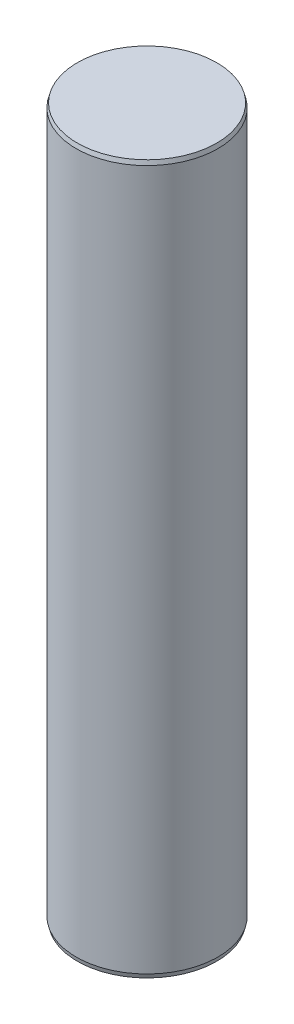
ISO-10303-21;
HEADER;
FILE_DESCRIPTION(('STEP AP214'),'2;1');
FILE_NAME('part.step','',(''),(''),'','','');
FILE_SCHEMA(('AUTOMOTIVE_DESIGN { 1 0 10303 214 1 1 1 1 }'));
ENDSEC;
DATA;
#1=APPLICATION_CONTEXT('core data for automotive mechanical design processes');
#2=APPLICATION_PROTOCOL_DEFINITION('international standard','automotive_design',2000,#1);
#3=PRODUCT_CONTEXT('',#1,'mechanical');
#4=PRODUCT('Part','Part','',(#3));
#5=PRODUCT_RELATED_PRODUCT_CATEGORY('part','',(#4));
#6=PRODUCT_DEFINITION_FORMATION('','',#4);
#7=PRODUCT_DEFINITION_CONTEXT('part definition',#1,'design');
#8=PRODUCT_DEFINITION('design','',#6,#7);
#9=PRODUCT_DEFINITION_SHAPE('','',#8);
#10=(LENGTH_UNIT() NAMED_UNIT(*) SI_UNIT(.MILLI.,.METRE.));
#11=(NAMED_UNIT(*) PLANE_ANGLE_UNIT() SI_UNIT($,.RADIAN.));
#12=(NAMED_UNIT(*) SI_UNIT($,.STERADIAN.) SOLID_ANGLE_UNIT());
#13=UNCERTAINTY_MEASURE_WITH_UNIT(LENGTH_MEASURE(1.E-05),#10,'distance_accuracy_value','');
#14=(GEOMETRIC_REPRESENTATION_CONTEXT(3) GLOBAL_UNCERTAINTY_ASSIGNED_CONTEXT((#13)) GLOBAL_UNIT_ASSIGNED_CONTEXT((#10,
#11,#12)) REPRESENTATION_CONTEXT('',''));
#15=CARTESIAN_POINT('',(0.,0.,0.));
#16=DIRECTION('',(0.,0.,1.));
#17=DIRECTION('',(1.,0.,0.));
#18=AXIS2_PLACEMENT_3D('',#15,#16,#17);
#19=CARTESIAN_POINT('',(0.,-20.,0.));
#20=DIRECTION('',(0.,1.,0.));
#21=DIRECTION('',(0.,0.,1.));
#22=AXIS2_PLACEMENT_3D('',#19,#20,#21);
#23=CONICAL_SURFACE('',#22,1.96784609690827,0.261799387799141);
#24=CARTESIAN_POINT('',(0.,-19.88,0.));
#25=DIRECTION('',(0.,-1.,0.));
#26=DIRECTION('',(0.,0.,-1.));
#27=AXIS2_PLACEMENT_3D('',#24,#25,#26);
#28=CIRCLE('',#27,2.);
#29=CARTESIAN_POINT('',(0.,-19.88,-2.));
#30=VERTEX_POINT('',#29);
#31=EDGE_CURVE('E10',#30,#30,#28,.T.);
#32=ORIENTED_EDGE('',*,*,#31,.T.);
#33=EDGE_LOOP('',(#32));
#34=FACE_BOUND('',#33,.T.);
#35=CARTESIAN_POINT('',(0.,-20.,0.));
#36=DIRECTION('',(0.,-1.,0.));
#37=DIRECTION('',(0.,0.,-1.));
#38=AXIS2_PLACEMENT_3D('',#35,#36,#37);
#39=CIRCLE('',#38,1.96784609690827);
#40=CARTESIAN_POINT('',(0.,-20.,-1.96784609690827));
#41=VERTEX_POINT('',#40);
#42=EDGE_CURVE('E43',#41,#41,#39,.T.);
#43=ORIENTED_EDGE('',*,*,#42,.F.);
#44=EDGE_LOOP('',(#43));
#45=FACE_BOUND('',#44,.T.);
#46=ADVANCED_FACE('F29',(#34,#45),#23,.T.);
#47=CARTESIAN_POINT('',(0.,0.,0.));
#48=DIRECTION('',(0.,-1.,0.));
#49=DIRECTION('',(0.,0.,-1.));
#50=AXIS2_PLACEMENT_3D('',#47,#48,#49);
#51=CYLINDRICAL_SURFACE('',#50,2.);
#52=CARTESIAN_POINT('',(0.,-0.120000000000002,0.));
#53=DIRECTION('',(0.,-1.,0.));
#54=DIRECTION('',(0.,0.,-1.));
#55=AXIS2_PLACEMENT_3D('',#52,#53,#54);
#56=CIRCLE('',#55,2.00000000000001);
#57=CARTESIAN_POINT('',(0.,-0.120000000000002,-2.00000000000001));
#58=VERTEX_POINT('',#57);
#59=EDGE_CURVE('E35',#58,#58,#56,.T.);
#60=ORIENTED_EDGE('',*,*,#59,.T.);
#61=EDGE_LOOP('',(#60));
#62=FACE_BOUND('',#61,.T.);
#63=ORIENTED_EDGE('',*,*,#31,.F.);
#64=EDGE_LOOP('',(#63));
#65=FACE_BOUND('',#64,.T.);
#66=ADVANCED_FACE('F52',(#62,#65),#51,.T.);
#67=CARTESIAN_POINT('',(0.,-0.120000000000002,0.));
#68=DIRECTION('',(0.,-1.,0.));
#69=DIRECTION('',(0.,0.,-1.));
#70=AXIS2_PLACEMENT_3D('',#67,#68,#69);
#71=CONICAL_SURFACE('',#70,2.00000000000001,0.261799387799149);
#72=CARTESIAN_POINT('',(0.,0.,0.));
#73=DIRECTION('',(0.,-1.,0.));
#74=DIRECTION('',(0.,0.,-1.));
#75=AXIS2_PLACEMENT_3D('',#72,#73,#74);
#76=CIRCLE('',#75,1.96784609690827);
#77=CARTESIAN_POINT('',(0.,0.,-1.96784609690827));
#78=VERTEX_POINT('',#77);
#79=EDGE_CURVE('E39',#78,#78,#76,.T.);
#80=ORIENTED_EDGE('',*,*,#79,.T.);
#81=EDGE_LOOP('',(#80));
#82=FACE_BOUND('',#81,.T.);
#83=ORIENTED_EDGE('',*,*,#59,.F.);
#84=EDGE_LOOP('',(#83));
#85=FACE_BOUND('',#84,.T.);
#86=ADVANCED_FACE('F56',(#82,#85),#71,.T.);
#87=CARTESIAN_POINT('',(0.,0.,0.));
#88=DIRECTION('',(0.,1.,0.));
#89=DIRECTION('',(0.,0.,1.));
#90=AXIS2_PLACEMENT_3D('',#87,#88,#89);
#91=PLANE('',#90);
#92=ORIENTED_EDGE('',*,*,#79,.F.);
#93=EDGE_LOOP('',(#92));
#94=FACE_BOUND('',#93,.T.);
#95=ADVANCED_FACE('F60',(#94),#91,.T.);
#96=CARTESIAN_POINT('',(0.,-20.,0.));
#97=DIRECTION('',(0.,-1.,0.));
#98=DIRECTION('',(0.,0.,-1.));
#99=AXIS2_PLACEMENT_3D('',#96,#97,#98);
#100=PLANE('',#99);
#101=ORIENTED_EDGE('',*,*,#42,.T.);
#102=EDGE_LOOP('',(#101));
#103=FACE_BOUND('',#102,.T.);
#104=ADVANCED_FACE('F49',(#103),#100,.T.);
#105=CLOSED_SHELL('',(#46,#66,#86,#95,#104));
#106=MANIFOLD_SOLID_BREP('B2',#105);
#107=ADVANCED_BREP_SHAPE_REPRESENTATION('',(#18,#106),#14);
#108=SHAPE_DEFINITION_REPRESENTATION(#9,#107);
ENDSEC;
END-ISO-10303-21;
